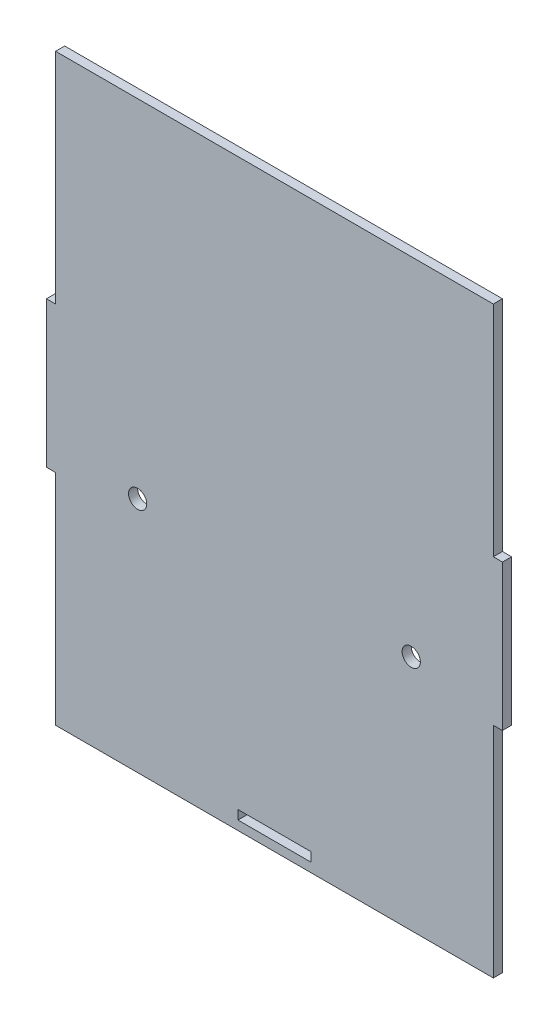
from build123d import *

# Parameters (mm, degrees)
SKETCH1_R           = 3.175
SKETCH1_W           = 25.4
SKETCH1_H           = 3.175
BOSS_EXTRUDE1_DEPTH = 3.175


with BuildPart() as part:
    # Sketch1 → Boss-Extrude1 (new body)
    with BuildSketch(Plane.XY):
        Polygon((-48.105752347, -98.617450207), (-48.105752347, -174.817450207), (104.294247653, -174.817450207), (104.294247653, -98.617450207), (107.469247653, -98.617450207), (107.469247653, -47.817450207), (104.294247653, -47.817450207), (104.294247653, 28.382549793), (-48.105752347, 28.382549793), (-48.105752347, -47.817450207), (-51.280752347, -47.817450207), (-51.280752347, -98.617450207), align=None)
        with Locations((-19.530752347, -92.267450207)):
            Circle(SKETCH1_R, mode=Mode.SUBTRACT)
        with Locations((75.719247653, -92.267450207)):
            Circle(SKETCH1_R, mode=Mode.SUBTRACT)
        with Locations((28.094247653, -170.054950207)):
            Rectangle(SKETCH1_W, SKETCH1_H, mode=Mode.SUBTRACT)
    extrude(amount=BOSS_EXTRUDE1_DEPTH)


solid = part.part
